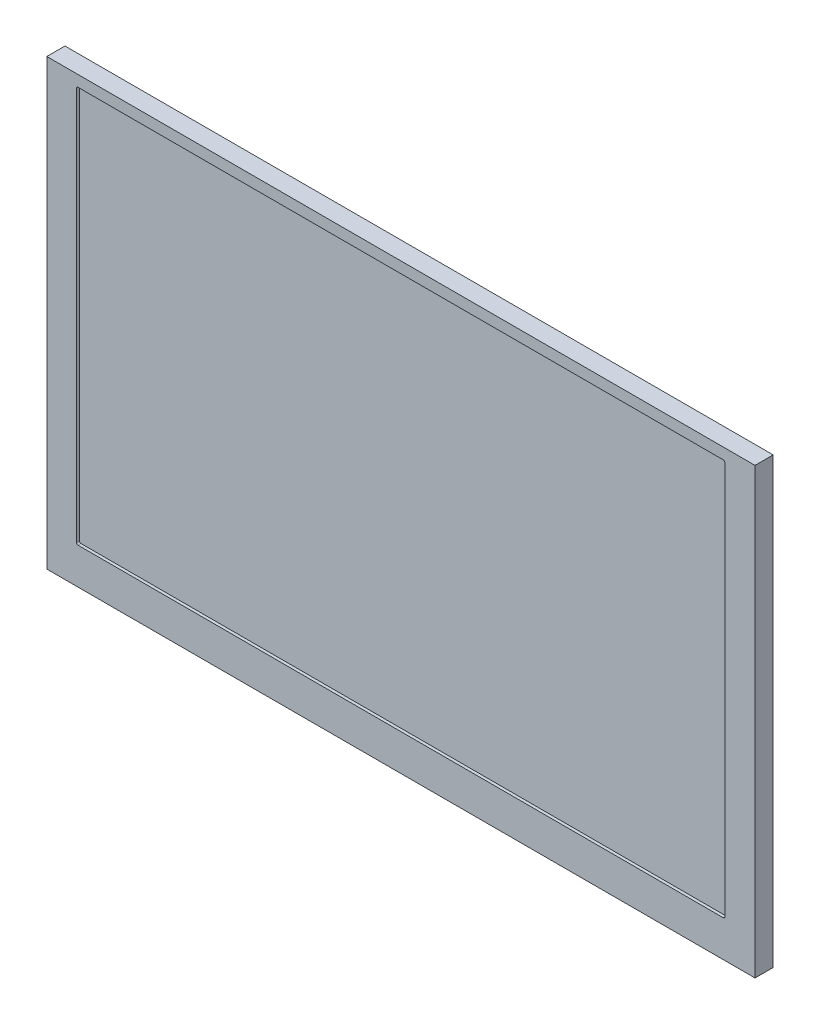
ISO-10303-21;
HEADER;
FILE_DESCRIPTION(('STEP AP214'),'2;1');
FILE_NAME('part.step','',(''),(''),'','','');
FILE_SCHEMA(('AUTOMOTIVE_DESIGN { 1 0 10303 214 1 1 1 1 }'));
ENDSEC;
DATA;
#1=APPLICATION_CONTEXT('core data for automotive mechanical design processes');
#2=APPLICATION_PROTOCOL_DEFINITION('international standard','automotive_design',2000,#1);
#3=PRODUCT_CONTEXT('',#1,'mechanical');
#4=PRODUCT('Part','Part','',(#3));
#5=PRODUCT_RELATED_PRODUCT_CATEGORY('part','',(#4));
#6=PRODUCT_DEFINITION_FORMATION('','',#4);
#7=PRODUCT_DEFINITION_CONTEXT('part definition',#1,'design');
#8=PRODUCT_DEFINITION('design','',#6,#7);
#9=PRODUCT_DEFINITION_SHAPE('','',#8);
#10=(LENGTH_UNIT() NAMED_UNIT(*) SI_UNIT(.MILLI.,.METRE.));
#11=(NAMED_UNIT(*) PLANE_ANGLE_UNIT() SI_UNIT($,.RADIAN.));
#12=(NAMED_UNIT(*) SI_UNIT($,.STERADIAN.) SOLID_ANGLE_UNIT());
#13=UNCERTAINTY_MEASURE_WITH_UNIT(LENGTH_MEASURE(1.E-05),#10,'distance_accuracy_value','');
#14=(GEOMETRIC_REPRESENTATION_CONTEXT(3) GLOBAL_UNCERTAINTY_ASSIGNED_CONTEXT((#13)) GLOBAL_UNIT_ASSIGNED_CONTEXT((#10,
#11,#12)) REPRESENTATION_CONTEXT('',''));
#15=CARTESIAN_POINT('',(0.,0.,0.));
#16=DIRECTION('',(0.,0.,1.));
#17=DIRECTION('',(1.,0.,0.));
#18=AXIS2_PLACEMENT_3D('',#15,#16,#17);
#19=CARTESIAN_POINT('',(-60.5,37.925,3.1));
#20=DIRECTION('',(1.,0.,0.));
#21=DIRECTION('',(0.,1.,0.));
#22=AXIS2_PLACEMENT_3D('',#19,#20,#21);
#23=PLANE('',#22);
#24=DIRECTION('',(0.,-1.,0.));
#25=VECTOR('',#24,1.);
#26=CARTESIAN_POINT('',(-60.5,37.925,0.));
#27=LINE('',#26,#25);
#28=CARTESIAN_POINT('',(-60.5,37.925,0.));
#29=VERTEX_POINT('',#28);
#30=CARTESIAN_POINT('',(-60.5,-37.925,0.));
#31=VERTEX_POINT('',#30);
#32=EDGE_CURVE('E190',#29,#31,#27,.T.);
#33=ORIENTED_EDGE('',*,*,#32,.T.);
#34=DIRECTION('',(0.,0.,-1.));
#35=VECTOR('',#34,1.);
#36=CARTESIAN_POINT('',(-60.5,-37.925,3.1));
#37=LINE('',#36,#35);
#38=CARTESIAN_POINT('',(-60.5,-37.925,3.1));
#39=VERTEX_POINT('',#38);
#40=EDGE_CURVE('E11',#39,#31,#37,.T.);
#41=ORIENTED_EDGE('',*,*,#40,.F.);
#42=DIRECTION('',(0.,-1.,0.));
#43=VECTOR('',#42,1.);
#44=CARTESIAN_POINT('',(-60.5,37.925,3.1));
#45=LINE('',#44,#43);
#46=CARTESIAN_POINT('',(-60.5,37.925,3.1));
#47=VERTEX_POINT('',#46);
#48=EDGE_CURVE('E202',#47,#39,#45,.T.);
#49=ORIENTED_EDGE('',*,*,#48,.F.);
#50=DIRECTION('',(0.,0.,-1.));
#51=VECTOR('',#50,1.);
#52=CARTESIAN_POINT('',(-60.5,37.925,3.1));
#53=LINE('',#52,#51);
#54=EDGE_CURVE('E208',#47,#29,#53,.T.);
#55=ORIENTED_EDGE('',*,*,#54,.T.);
#56=EDGE_LOOP('',(#33,#41,#49,#55));
#57=FACE_BOUND('',#56,.T.);
#58=ADVANCED_FACE('F34',(#57),#23,.F.);
#59=CARTESIAN_POINT('',(-60.5,-37.925,3.1));
#60=DIRECTION('',(0.,1.,0.));
#61=DIRECTION('',(0.,0.,1.));
#62=AXIS2_PLACEMENT_3D('',#59,#60,#61);
#63=PLANE('',#62);
#64=DIRECTION('',(1.,0.,0.));
#65=VECTOR('',#64,1.);
#66=CARTESIAN_POINT('',(-60.5,-37.925,0.));
#67=LINE('',#66,#65);
#68=CARTESIAN_POINT('',(60.5,-37.925,0.));
#69=VERTEX_POINT('',#68);
#70=EDGE_CURVE('E211',#31,#69,#67,.T.);
#71=ORIENTED_EDGE('',*,*,#70,.T.);
#72=DIRECTION('',(0.,0.,-1.));
#73=VECTOR('',#72,1.);
#74=CARTESIAN_POINT('',(60.5,-37.925,3.1));
#75=LINE('',#74,#73);
#76=CARTESIAN_POINT('',(60.5,-37.925,3.1));
#77=VERTEX_POINT('',#76);
#78=EDGE_CURVE('E41',#77,#69,#75,.T.);
#79=ORIENTED_EDGE('',*,*,#78,.F.);
#80=DIRECTION('',(1.,0.,0.));
#81=VECTOR('',#80,1.);
#82=CARTESIAN_POINT('',(-60.5,-37.925,3.1));
#83=LINE('',#82,#81);
#84=EDGE_CURVE('E85',#39,#77,#83,.T.);
#85=ORIENTED_EDGE('',*,*,#84,.F.);
#86=ORIENTED_EDGE('',*,*,#40,.T.);
#87=EDGE_LOOP('',(#71,#79,#85,#86));
#88=FACE_BOUND('',#87,.T.);
#89=ADVANCED_FACE('F240',(#88),#63,.F.);
#90=CARTESIAN_POINT('',(60.5,37.925,3.1));
#91=DIRECTION('',(-1.,0.,0.));
#92=DIRECTION('',(0.,-1.,0.));
#93=AXIS2_PLACEMENT_3D('',#90,#91,#92);
#94=PLANE('',#93);
#95=DIRECTION('',(0.,1.,0.));
#96=VECTOR('',#95,1.);
#97=CARTESIAN_POINT('',(60.5,37.925,0.));
#98=LINE('',#97,#96);
#99=CARTESIAN_POINT('',(60.5,37.925,0.));
#100=VERTEX_POINT('',#99);
#101=EDGE_CURVE('E213',#69,#100,#98,.T.);
#102=ORIENTED_EDGE('',*,*,#101,.T.);
#103=DIRECTION('',(0.,0.,-1.));
#104=VECTOR('',#103,1.);
#105=CARTESIAN_POINT('',(60.5,37.925,3.1));
#106=LINE('',#105,#104);
#107=CARTESIAN_POINT('',(60.5,37.925,3.1));
#108=VERTEX_POINT('',#107);
#109=EDGE_CURVE('E217',#108,#100,#106,.T.);
#110=ORIENTED_EDGE('',*,*,#109,.F.);
#111=DIRECTION('',(0.,1.,0.));
#112=VECTOR('',#111,1.);
#113=CARTESIAN_POINT('',(60.5,37.925,3.1));
#114=LINE('',#113,#112);
#115=EDGE_CURVE('E205',#77,#108,#114,.T.);
#116=ORIENTED_EDGE('',*,*,#115,.F.);
#117=ORIENTED_EDGE('',*,*,#78,.T.);
#118=EDGE_LOOP('',(#102,#110,#116,#117));
#119=FACE_BOUND('',#118,.T.);
#120=ADVANCED_FACE('F222',(#119),#94,.F.);
#121=CARTESIAN_POINT('',(-60.5,37.925,3.1));
#122=DIRECTION('',(0.,-1.,0.));
#123=DIRECTION('',(0.,0.,-1.));
#124=AXIS2_PLACEMENT_3D('',#121,#122,#123);
#125=PLANE('',#124);
#126=DIRECTION('',(-1.,0.,0.));
#127=VECTOR('',#126,1.);
#128=CARTESIAN_POINT('',(-60.5,37.925,0.));
#129=LINE('',#128,#127);
#130=EDGE_CURVE('E78',#100,#29,#129,.T.);
#131=ORIENTED_EDGE('',*,*,#130,.T.);
#132=ORIENTED_EDGE('',*,*,#54,.F.);
#133=DIRECTION('',(-1.,0.,0.));
#134=VECTOR('',#133,1.);
#135=CARTESIAN_POINT('',(-60.5,37.925,3.1));
#136=LINE('',#135,#134);
#137=EDGE_CURVE('E57',#108,#47,#136,.T.);
#138=ORIENTED_EDGE('',*,*,#137,.F.);
#139=ORIENTED_EDGE('',*,*,#109,.T.);
#140=EDGE_LOOP('',(#131,#132,#138,#139));
#141=FACE_BOUND('',#140,.T.);
#142=ADVANCED_FACE('F230',(#141),#125,.F.);
#143=CARTESIAN_POINT('',(0.,0.,3.1));
#144=DIRECTION('',(0.,0.,1.));
#145=DIRECTION('',(1.,0.,0.));
#146=AXIS2_PLACEMENT_3D('',#143,#144,#145);
#147=PLANE('',#146);
#148=CARTESIAN_POINT('',(55.0499999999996,-31.4200000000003,3.1));
#149=DIRECTION('',(0.,0.,1.));
#150=DIRECTION('',(1.,0.,0.));
#151=AXIS2_PLACEMENT_3D('',#148,#149,#150);
#152=CIRCLE('',#151,0.299999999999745);
#153=CARTESIAN_POINT('',(55.0500000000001,-31.72,3.1));
#154=VERTEX_POINT('',#153);
#155=CARTESIAN_POINT('',(55.3499999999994,-31.4199999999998,3.1));
#156=VERTEX_POINT('',#155);
#157=EDGE_CURVE('E48',#154,#156,#152,.T.);
#158=ORIENTED_EDGE('',*,*,#157,.F.);
#159=DIRECTION('',(1.,0.,0.));
#160=VECTOR('',#159,1.);
#161=CARTESIAN_POINT('',(-55.1499999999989,-31.72,3.1));
#162=LINE('',#161,#160);
#163=CARTESIAN_POINT('',(-55.1499999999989,-31.72,3.1));
#164=VERTEX_POINT('',#163);
#165=EDGE_CURVE('E152',#164,#154,#162,.T.);
#166=ORIENTED_EDGE('',*,*,#165,.F.);
#167=CARTESIAN_POINT('',(-55.1499999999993,-31.4199999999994,3.1));
#168=DIRECTION('',(0.,0.,1.));
#169=DIRECTION('',(1.,0.,0.));
#170=AXIS2_PLACEMENT_3D('',#167,#168,#169);
#171=CIRCLE('',#170,0.300000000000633);
#172=CARTESIAN_POINT('',(-55.45,-31.4199999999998,3.1));
#173=VERTEX_POINT('',#172);
#174=EDGE_CURVE('E155',#173,#164,#171,.T.);
#175=ORIENTED_EDGE('',*,*,#174,.F.);
#176=DIRECTION('',(0.,-1.,0.));
#177=VECTOR('',#176,1.);
#178=CARTESIAN_POINT('',(-55.45,35.7300000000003,3.1));
#179=LINE('',#178,#177);
#180=CARTESIAN_POINT('',(-55.45,35.7300000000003,3.1));
#181=VERTEX_POINT('',#180);
#182=EDGE_CURVE('E183',#181,#173,#179,.T.);
#183=ORIENTED_EDGE('',*,*,#182,.F.);
#184=CARTESIAN_POINT('',(-55.1499999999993,35.7299999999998,3.1));
#185=DIRECTION('',(0.,0.,1.));
#186=DIRECTION('',(1.,0.,0.));
#187=AXIS2_PLACEMENT_3D('',#184,#185,#186);
#188=CIRCLE('',#187,0.300000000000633);
#189=CARTESIAN_POINT('',(-55.1499999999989,36.0300000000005,3.1));
#190=VERTEX_POINT('',#189);
#191=EDGE_CURVE('E180',#190,#181,#188,.T.);
#192=ORIENTED_EDGE('',*,*,#191,.F.);
#193=DIRECTION('',(-1.,0.,0.));
#194=VECTOR('',#193,1.);
#195=CARTESIAN_POINT('',(55.0500000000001,36.0300000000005,3.1));
#196=LINE('',#195,#194);
#197=CARTESIAN_POINT('',(55.0500000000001,36.0300000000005,3.1));
#198=VERTEX_POINT('',#197);
#199=EDGE_CURVE('E177',#198,#190,#196,.T.);
#200=ORIENTED_EDGE('',*,*,#199,.F.);
#201=CARTESIAN_POINT('',(55.0499999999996,35.7300000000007,3.1));
#202=DIRECTION('',(0.,0.,1.));
#203=DIRECTION('',(1.,0.,0.));
#204=AXIS2_PLACEMENT_3D('',#201,#202,#203);
#205=CIRCLE('',#204,0.299999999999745);
#206=CARTESIAN_POINT('',(55.3499999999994,35.7300000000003,3.1));
#207=VERTEX_POINT('',#206);
#208=EDGE_CURVE('E174',#207,#198,#205,.T.);
#209=ORIENTED_EDGE('',*,*,#208,.F.);
#210=DIRECTION('',(0.,1.,0.));
#211=VECTOR('',#210,1.);
#212=CARTESIAN_POINT('',(55.3499999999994,-31.4199999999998,3.1));
#213=LINE('',#212,#211);
#214=EDGE_CURVE('E172',#156,#207,#213,.T.);
#215=ORIENTED_EDGE('',*,*,#214,.F.);
#216=EDGE_LOOP('',(#158,#166,#175,#183,#192,#200,#209,#215));
#217=FACE_BOUND('',#216,.T.);
#218=ORIENTED_EDGE('',*,*,#48,.T.);
#219=ORIENTED_EDGE('',*,*,#84,.T.);
#220=ORIENTED_EDGE('',*,*,#115,.T.);
#221=ORIENTED_EDGE('',*,*,#137,.T.);
#222=EDGE_LOOP('',(#218,#219,#220,#221));
#223=FACE_BOUND('',#222,.T.);
#224=ADVANCED_FACE('F232',(#217,#223),#147,.T.);
#225=CARTESIAN_POINT('',(0.,0.,0.));
#226=DIRECTION('',(0.,0.,1.));
#227=DIRECTION('',(1.,0.,0.));
#228=AXIS2_PLACEMENT_3D('',#225,#226,#227);
#229=PLANE('',#228);
#230=ORIENTED_EDGE('',*,*,#32,.F.);
#231=ORIENTED_EDGE('',*,*,#130,.F.);
#232=ORIENTED_EDGE('',*,*,#101,.F.);
#233=ORIENTED_EDGE('',*,*,#70,.F.);
#234=EDGE_LOOP('',(#230,#231,#232,#233));
#235=FACE_BOUND('',#234,.T.);
#236=ADVANCED_FACE('F226',(#235),#229,.F.);
#237=CARTESIAN_POINT('',(55.0499999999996,-31.4200000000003,2.6));
#238=DIRECTION('',(0.,0.,1.));
#239=DIRECTION('',(1.,0.,0.));
#240=AXIS2_PLACEMENT_3D('',#237,#238,#239);
#241=CYLINDRICAL_SURFACE('',#240,0.299999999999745);
#242=ORIENTED_EDGE('',*,*,#157,.T.);
#243=DIRECTION('',(0.,0.,1.));
#244=VECTOR('',#243,1.);
#245=CARTESIAN_POINT('',(55.3499999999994,-31.4199999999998,2.6));
#246=LINE('',#245,#244);
#247=CARTESIAN_POINT('',(55.3499999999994,-31.4199999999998,2.6));
#248=VERTEX_POINT('',#247);
#249=EDGE_CURVE('E129',#248,#156,#246,.T.);
#250=ORIENTED_EDGE('',*,*,#249,.F.);
#251=CARTESIAN_POINT('',(55.0499999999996,-31.4200000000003,2.6));
#252=DIRECTION('',(0.,0.,1.));
#253=DIRECTION('',(1.,0.,0.));
#254=AXIS2_PLACEMENT_3D('',#251,#252,#253);
#255=CIRCLE('',#254,0.299999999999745);
#256=CARTESIAN_POINT('',(55.0500000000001,-31.72,2.6));
#257=VERTEX_POINT('',#256);
#258=EDGE_CURVE('E133',#257,#248,#255,.T.);
#259=ORIENTED_EDGE('',*,*,#258,.F.);
#260=DIRECTION('',(0.,0.,1.));
#261=VECTOR('',#260,1.);
#262=CARTESIAN_POINT('',(55.0500000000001,-31.72,2.6));
#263=LINE('',#262,#261);
#264=EDGE_CURVE('E188',#257,#154,#263,.T.);
#265=ORIENTED_EDGE('',*,*,#264,.T.);
#266=EDGE_LOOP('',(#242,#250,#259,#265));
#267=FACE_BOUND('',#266,.T.);
#268=ADVANCED_FACE('F131',(#267),#241,.F.);
#269=CARTESIAN_POINT('',(-55.1499999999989,-31.72,2.6));
#270=DIRECTION('',(0.,-1.,0.));
#271=DIRECTION('',(0.,0.,-1.));
#272=AXIS2_PLACEMENT_3D('',#269,#270,#271);
#273=PLANE('',#272);
#274=ORIENTED_EDGE('',*,*,#165,.T.);
#275=ORIENTED_EDGE('',*,*,#264,.F.);
#276=DIRECTION('',(1.,0.,0.));
#277=VECTOR('',#276,1.);
#278=CARTESIAN_POINT('',(-55.1499999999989,-31.72,2.6));
#279=LINE('',#278,#277);
#280=CARTESIAN_POINT('',(-55.1499999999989,-31.72,2.6));
#281=VERTEX_POINT('',#280);
#282=EDGE_CURVE('E139',#281,#257,#279,.T.);
#283=ORIENTED_EDGE('',*,*,#282,.F.);
#284=DIRECTION('',(0.,0.,1.));
#285=VECTOR('',#284,1.);
#286=CARTESIAN_POINT('',(-55.1499999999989,-31.72,2.6));
#287=LINE('',#286,#285);
#288=EDGE_CURVE('E191',#281,#164,#287,.T.);
#289=ORIENTED_EDGE('',*,*,#288,.T.);
#290=EDGE_LOOP('',(#274,#275,#283,#289));
#291=FACE_BOUND('',#290,.T.);
#292=ADVANCED_FACE('F280',(#291),#273,.F.);
#293=CARTESIAN_POINT('',(-55.1499999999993,-31.4199999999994,2.6));
#294=DIRECTION('',(0.,0.,1.));
#295=DIRECTION('',(1.,0.,0.));
#296=AXIS2_PLACEMENT_3D('',#293,#294,#295);
#297=CYLINDRICAL_SURFACE('',#296,0.300000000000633);
#298=ORIENTED_EDGE('',*,*,#174,.T.);
#299=ORIENTED_EDGE('',*,*,#288,.F.);
#300=CARTESIAN_POINT('',(-55.1499999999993,-31.4199999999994,2.6));
#301=DIRECTION('',(0.,0.,1.));
#302=DIRECTION('',(1.,0.,0.));
#303=AXIS2_PLACEMENT_3D('',#300,#301,#302);
#304=CIRCLE('',#303,0.300000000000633);
#305=CARTESIAN_POINT('',(-55.45,-31.4199999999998,2.6));
#306=VERTEX_POINT('',#305);
#307=EDGE_CURVE('E168',#306,#281,#304,.T.);
#308=ORIENTED_EDGE('',*,*,#307,.F.);
#309=DIRECTION('',(0.,0.,1.));
#310=VECTOR('',#309,1.);
#311=CARTESIAN_POINT('',(-55.45,-31.4199999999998,2.6));
#312=LINE('',#311,#310);
#313=EDGE_CURVE('E193',#306,#173,#312,.T.);
#314=ORIENTED_EDGE('',*,*,#313,.T.);
#315=EDGE_LOOP('',(#298,#299,#308,#314));
#316=FACE_BOUND('',#315,.T.);
#317=ADVANCED_FACE('F291',(#316),#297,.F.);
#318=CARTESIAN_POINT('',(-55.45,35.7300000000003,2.6));
#319=DIRECTION('',(-1.,0.,0.));
#320=DIRECTION('',(0.,0.,1.));
#321=AXIS2_PLACEMENT_3D('',#318,#319,#320);
#322=PLANE('',#321);
#323=ORIENTED_EDGE('',*,*,#182,.T.);
#324=ORIENTED_EDGE('',*,*,#313,.F.);
#325=DIRECTION('',(0.,-1.,0.));
#326=VECTOR('',#325,1.);
#327=CARTESIAN_POINT('',(-55.45,35.7300000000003,2.6));
#328=LINE('',#327,#326);
#329=CARTESIAN_POINT('',(-55.45,35.7300000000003,2.6));
#330=VERTEX_POINT('',#329);
#331=EDGE_CURVE('E165',#330,#306,#328,.T.);
#332=ORIENTED_EDGE('',*,*,#331,.F.);
#333=DIRECTION('',(0.,0.,1.));
#334=VECTOR('',#333,1.);
#335=CARTESIAN_POINT('',(-55.45,35.7300000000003,2.6));
#336=LINE('',#335,#334);
#337=EDGE_CURVE('E195',#330,#181,#336,.T.);
#338=ORIENTED_EDGE('',*,*,#337,.T.);
#339=EDGE_LOOP('',(#323,#324,#332,#338));
#340=FACE_BOUND('',#339,.T.);
#341=ADVANCED_FACE('F302',(#340),#322,.F.);
#342=CARTESIAN_POINT('',(-55.1499999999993,35.7299999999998,2.6));
#343=DIRECTION('',(0.,0.,1.));
#344=DIRECTION('',(1.,0.,0.));
#345=AXIS2_PLACEMENT_3D('',#342,#343,#344);
#346=CYLINDRICAL_SURFACE('',#345,0.300000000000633);
#347=ORIENTED_EDGE('',*,*,#191,.T.);
#348=ORIENTED_EDGE('',*,*,#337,.F.);
#349=CARTESIAN_POINT('',(-55.1499999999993,35.7299999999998,2.6));
#350=DIRECTION('',(0.,0.,1.));
#351=DIRECTION('',(1.,0.,0.));
#352=AXIS2_PLACEMENT_3D('',#349,#350,#351);
#353=CIRCLE('',#352,0.300000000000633);
#354=CARTESIAN_POINT('',(-55.1499999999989,36.0300000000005,2.6));
#355=VERTEX_POINT('',#354);
#356=EDGE_CURVE('E162',#355,#330,#353,.T.);
#357=ORIENTED_EDGE('',*,*,#356,.F.);
#358=DIRECTION('',(0.,0.,1.));
#359=VECTOR('',#358,1.);
#360=CARTESIAN_POINT('',(-55.1499999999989,36.0300000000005,2.6));
#361=LINE('',#360,#359);
#362=EDGE_CURVE('E197',#355,#190,#361,.T.);
#363=ORIENTED_EDGE('',*,*,#362,.T.);
#364=EDGE_LOOP('',(#347,#348,#357,#363));
#365=FACE_BOUND('',#364,.T.);
#366=ADVANCED_FACE('F313',(#365),#346,.F.);
#367=CARTESIAN_POINT('',(55.0500000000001,36.0300000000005,2.6));
#368=DIRECTION('',(0.,1.,0.));
#369=DIRECTION('',(0.,0.,1.));
#370=AXIS2_PLACEMENT_3D('',#367,#368,#369);
#371=PLANE('',#370);
#372=ORIENTED_EDGE('',*,*,#199,.T.);
#373=ORIENTED_EDGE('',*,*,#362,.F.);
#374=DIRECTION('',(-1.,0.,0.));
#375=VECTOR('',#374,1.);
#376=CARTESIAN_POINT('',(55.0500000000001,36.0300000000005,2.6));
#377=LINE('',#376,#375);
#378=CARTESIAN_POINT('',(55.0500000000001,36.0300000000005,2.6));
#379=VERTEX_POINT('',#378);
#380=EDGE_CURVE('E159',#379,#355,#377,.T.);
#381=ORIENTED_EDGE('',*,*,#380,.F.);
#382=DIRECTION('',(0.,0.,1.));
#383=VECTOR('',#382,1.);
#384=CARTESIAN_POINT('',(55.0500000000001,36.0300000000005,2.6));
#385=LINE('',#384,#383);
#386=EDGE_CURVE('E199',#379,#198,#385,.T.);
#387=ORIENTED_EDGE('',*,*,#386,.T.);
#388=EDGE_LOOP('',(#372,#373,#381,#387));
#389=FACE_BOUND('',#388,.T.);
#390=ADVANCED_FACE('F325',(#389),#371,.F.);
#391=CARTESIAN_POINT('',(55.0499999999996,35.7300000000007,2.6));
#392=DIRECTION('',(0.,0.,1.));
#393=DIRECTION('',(1.,0.,0.));
#394=AXIS2_PLACEMENT_3D('',#391,#392,#393);
#395=CYLINDRICAL_SURFACE('',#394,0.299999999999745);
#396=ORIENTED_EDGE('',*,*,#208,.T.);
#397=ORIENTED_EDGE('',*,*,#386,.F.);
#398=CARTESIAN_POINT('',(55.0499999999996,35.7300000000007,2.6));
#399=DIRECTION('',(0.,0.,1.));
#400=DIRECTION('',(1.,0.,0.));
#401=AXIS2_PLACEMENT_3D('',#398,#399,#400);
#402=CIRCLE('',#401,0.299999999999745);
#403=CARTESIAN_POINT('',(55.3499999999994,35.7300000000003,2.6));
#404=VERTEX_POINT('',#403);
#405=EDGE_CURVE('E147',#404,#379,#402,.T.);
#406=ORIENTED_EDGE('',*,*,#405,.F.);
#407=DIRECTION('',(0.,0.,1.));
#408=VECTOR('',#407,1.);
#409=CARTESIAN_POINT('',(55.3499999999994,35.7300000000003,2.6));
#410=LINE('',#409,#408);
#411=EDGE_CURVE('E138',#404,#207,#410,.T.);
#412=ORIENTED_EDGE('',*,*,#411,.T.);
#413=EDGE_LOOP('',(#396,#397,#406,#412));
#414=FACE_BOUND('',#413,.T.);
#415=ADVANCED_FACE('F336',(#414),#395,.F.);
#416=CARTESIAN_POINT('',(55.3499999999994,-31.4199999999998,2.6));
#417=DIRECTION('',(1.,0.,0.));
#418=DIRECTION('',(0.,0.,-1.));
#419=AXIS2_PLACEMENT_3D('',#416,#417,#418);
#420=PLANE('',#419);
#421=ORIENTED_EDGE('',*,*,#214,.T.);
#422=ORIENTED_EDGE('',*,*,#411,.F.);
#423=DIRECTION('',(0.,1.,0.));
#424=VECTOR('',#423,1.);
#425=CARTESIAN_POINT('',(55.3499999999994,-31.4199999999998,2.6));
#426=LINE('',#425,#424);
#427=EDGE_CURVE('E142',#248,#404,#426,.T.);
#428=ORIENTED_EDGE('',*,*,#427,.F.);
#429=ORIENTED_EDGE('',*,*,#249,.T.);
#430=EDGE_LOOP('',(#421,#422,#428,#429));
#431=FACE_BOUND('',#430,.T.);
#432=ADVANCED_FACE('F143',(#431),#420,.F.);
#433=CARTESIAN_POINT('',(55.0499999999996,-31.4200000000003,2.6));
#434=DIRECTION('',(0.,0.,1.));
#435=DIRECTION('',(1.,0.,0.));
#436=AXIS2_PLACEMENT_3D('',#433,#434,#435);
#437=PLANE('',#436);
#438=ORIENTED_EDGE('',*,*,#258,.T.);
#439=ORIENTED_EDGE('',*,*,#427,.T.);
#440=ORIENTED_EDGE('',*,*,#405,.T.);
#441=ORIENTED_EDGE('',*,*,#380,.T.);
#442=ORIENTED_EDGE('',*,*,#356,.T.);
#443=ORIENTED_EDGE('',*,*,#331,.T.);
#444=ORIENTED_EDGE('',*,*,#307,.T.);
#445=ORIENTED_EDGE('',*,*,#282,.T.);
#446=EDGE_LOOP('',(#438,#439,#440,#441,#442,#443,#444,#445));
#447=FACE_BOUND('',#446,.T.);
#448=ADVANCED_FACE('F149',(#447),#437,.T.);
#449=CLOSED_SHELL('',(#58,#89,#120,#142,#224,#236,#268,#292,#317,#341,#366,#390,#415,#432,#448));
#450=MANIFOLD_SOLID_BREP('B2',#449);
#451=ADVANCED_BREP_SHAPE_REPRESENTATION('',(#18,#450),#14);
#452=SHAPE_DEFINITION_REPRESENTATION(#9,#451);
ENDSEC;
END-ISO-10303-21;
